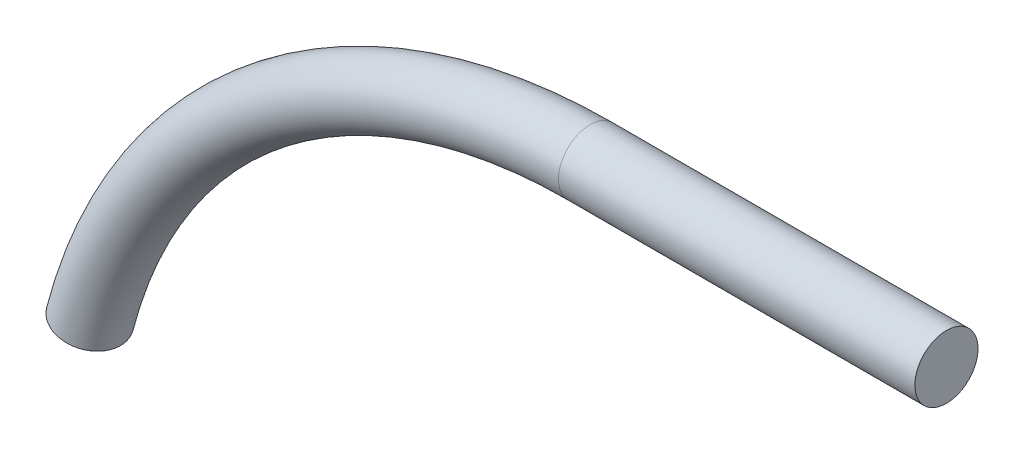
ISO-10303-21;
HEADER;
FILE_DESCRIPTION(('STEP AP214'),'2;1');
FILE_NAME('part.step','',(''),(''),'','','');
FILE_SCHEMA(('AUTOMOTIVE_DESIGN { 1 0 10303 214 1 1 1 1 }'));
ENDSEC;
DATA;
#1=APPLICATION_CONTEXT('core data for automotive mechanical design processes');
#2=APPLICATION_PROTOCOL_DEFINITION('international standard','automotive_design',2000,#1);
#3=PRODUCT_CONTEXT('',#1,'mechanical');
#4=PRODUCT('Part','Part','',(#3));
#5=PRODUCT_RELATED_PRODUCT_CATEGORY('part','',(#4));
#6=PRODUCT_DEFINITION_FORMATION('','',#4);
#7=PRODUCT_DEFINITION_CONTEXT('part definition',#1,'design');
#8=PRODUCT_DEFINITION('design','',#6,#7);
#9=PRODUCT_DEFINITION_SHAPE('','',#8);
#10=(LENGTH_UNIT() NAMED_UNIT(*) SI_UNIT(.MILLI.,.METRE.));
#11=(NAMED_UNIT(*) PLANE_ANGLE_UNIT() SI_UNIT($,.RADIAN.));
#12=(NAMED_UNIT(*) SI_UNIT($,.STERADIAN.) SOLID_ANGLE_UNIT());
#13=UNCERTAINTY_MEASURE_WITH_UNIT(LENGTH_MEASURE(1.E-05),#10,'distance_accuracy_value','');
#14=(GEOMETRIC_REPRESENTATION_CONTEXT(3) GLOBAL_UNCERTAINTY_ASSIGNED_CONTEXT((#13)) GLOBAL_UNIT_ASSIGNED_CONTEXT((#10,
#11,#12)) REPRESENTATION_CONTEXT('',''));
#15=CARTESIAN_POINT('',(0.,0.,0.));
#16=DIRECTION('',(0.,0.,1.));
#17=DIRECTION('',(1.,0.,0.));
#18=AXIS2_PLACEMENT_3D('',#15,#16,#17);
#19=CARTESIAN_POINT('',(-28.207244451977,-40.9002926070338,0.));
#20=DIRECTION('',(0.,0.,1.));
#21=DIRECTION('',(1.,0.,0.));
#22=AXIS2_PLACEMENT_3D('',#19,#20,#21);
#23=TOROIDAL_SURFACE('',#22,40.9002926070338,2.5);
#24=CARTESIAN_POINT('',(-28.207244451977,0.,0.));
#25=DIRECTION('',(1.,0.,0.));
#26=DIRECTION('',(0.,0.,-1.));
#27=AXIS2_PLACEMENT_3D('',#24,#25,#26);
#28=CIRCLE('',#27,2.5);
#29=CARTESIAN_POINT('',(-28.207244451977,2.5,0.));
#30=VERTEX_POINT('',#29);
#31=EDGE_CURVE('E36',#30,#30,#28,.T.);
#32=CARTESIAN_POINT('',(-67.7883012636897,-30.5962217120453,0.));
#33=DIRECTION('',(0.251931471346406,0.967745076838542,0.));
#34=DIRECTION('',(0.,0.,-1.));
#35=AXIS2_PLACEMENT_3D('',#32,#33,#34);
#36=CIRCLE('',#35,2.5);
#37=CARTESIAN_POINT('',(-70.2076639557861,-29.9663930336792,0.));
#38=VERTEX_POINT('',#37);
#39=EDGE_CURVE('E10',#38,#38,#36,.T.);
#40=CARTESIAN_POINT('',(-28.207244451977,-40.9002926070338,0.));
#41=DIRECTION('',(0.,0.,1.));
#42=DIRECTION('',(1.,0.,0.));
#43=AXIS2_PLACEMENT_3D('',#40,#41,#42);
#44=CIRCLE('',#43,43.4002926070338);
#45=EDGE_CURVE('',#30,#38,#44,.T.);
#46=ORIENTED_EDGE('',*,*,#31,.F.);
#47=ORIENTED_EDGE('',*,*,#39,.T.);
#48=ORIENTED_EDGE('',*,*,#45,.T.);
#49=ORIENTED_EDGE('',*,*,#45,.F.);
#50=EDGE_LOOP('',(#46,#48,#47,#49));
#51=FACE_BOUND('',#50,.T.);
#52=ADVANCED_FACE('F30',(#51),#23,.T.);
#53=CARTESIAN_POINT('',(-28.207244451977,0.,0.));
#54=DIRECTION('',(1.,0.,0.));
#55=DIRECTION('',(0.,1.,0.));
#56=AXIS2_PLACEMENT_3D('',#53,#54,#55);
#57=CYLINDRICAL_SURFACE('',#56,2.5);
#58=CARTESIAN_POINT('',(0.,0.,0.));
#59=DIRECTION('',(1.,0.,0.));
#60=DIRECTION('',(0.,0.,-1.));
#61=AXIS2_PLACEMENT_3D('',#58,#59,#60);
#62=CIRCLE('',#61,2.5);
#63=CARTESIAN_POINT('',(0.,2.49999999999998,0.));
#64=VERTEX_POINT('',#63);
#65=EDGE_CURVE('E40',#64,#64,#62,.T.);
#66=CARTESIAN_POINT('',(-28.207244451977,2.49999999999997,0.));
#67=CARTESIAN_POINT('',(-27.9134189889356,2.49999999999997,0.));
#68=CARTESIAN_POINT('',(-27.6195935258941,2.49999999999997,0.));
#69=CARTESIAN_POINT('',(-27.0319425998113,2.49999999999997,0.));
#70=CARTESIAN_POINT('',(-26.7381171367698,2.49999999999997,0.));
#71=CARTESIAN_POINT('',(-26.150466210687,2.49999999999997,0.));
#72=CARTESIAN_POINT('',(-25.8566407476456,2.49999999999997,0.));
#73=CARTESIAN_POINT('',(-25.2689898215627,2.49999999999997,0.));
#74=CARTESIAN_POINT('',(-24.9751643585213,2.49999999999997,0.));
#75=CARTESIAN_POINT('',(-24.3875134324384,2.49999999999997,0.));
#76=CARTESIAN_POINT('',(-24.093687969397,2.49999999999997,0.));
#77=CARTESIAN_POINT('',(-23.5060370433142,2.49999999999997,0.));
#78=CARTESIAN_POINT('',(-23.2122115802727,2.49999999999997,0.));
#79=CARTESIAN_POINT('',(-22.6245606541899,2.49999999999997,0.));
#80=CARTESIAN_POINT('',(-22.3307351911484,2.49999999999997,0.));
#81=CARTESIAN_POINT('',(-21.7430842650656,2.49999999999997,0.));
#82=CARTESIAN_POINT('',(-21.4492588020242,2.49999999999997,0.));
#83=CARTESIAN_POINT('',(-20.8616078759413,2.49999999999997,0.));
#84=CARTESIAN_POINT('',(-20.5677824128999,2.49999999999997,0.));
#85=CARTESIAN_POINT('',(-19.980131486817,2.49999999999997,0.));
#86=CARTESIAN_POINT('',(-19.6863060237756,2.49999999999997,0.));
#87=CARTESIAN_POINT('',(-19.0986550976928,2.49999999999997,0.));
#88=CARTESIAN_POINT('',(-18.8048296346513,2.49999999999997,0.));
#89=CARTESIAN_POINT('',(-18.2171787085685,2.49999999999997,0.));
#90=CARTESIAN_POINT('',(-17.923353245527,2.49999999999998,0.));
#91=CARTESIAN_POINT('',(-17.3357023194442,2.49999999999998,0.));
#92=CARTESIAN_POINT('',(-17.0418768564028,2.49999999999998,0.));
#93=CARTESIAN_POINT('',(-16.4542259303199,2.49999999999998,0.));
#94=CARTESIAN_POINT('',(-16.1604004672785,2.49999999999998,0.));
#95=CARTESIAN_POINT('',(-15.5727495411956,2.49999999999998,0.));
#96=CARTESIAN_POINT('',(-15.2789240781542,2.49999999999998,0.));
#97=CARTESIAN_POINT('',(-14.6912731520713,2.49999999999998,0.));
#98=CARTESIAN_POINT('',(-14.3974476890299,2.49999999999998,0.));
#99=CARTESIAN_POINT('',(-13.8097967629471,2.49999999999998,0.));
#100=CARTESIAN_POINT('',(-13.5159712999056,2.49999999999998,0.));
#101=CARTESIAN_POINT('',(-12.9283203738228,2.49999999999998,0.));
#102=CARTESIAN_POINT('',(-12.6344949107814,2.49999999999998,0.));
#103=CARTESIAN_POINT('',(-12.0468439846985,2.49999999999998,0.));
#104=CARTESIAN_POINT('',(-11.7530185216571,2.49999999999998,0.));
#105=CARTESIAN_POINT('',(-11.1653675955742,2.49999999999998,0.));
#106=CARTESIAN_POINT('',(-10.8715421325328,2.49999999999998,0.));
#107=CARTESIAN_POINT('',(-10.2838912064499,2.49999999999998,0.));
#108=CARTESIAN_POINT('',(-9.99006574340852,2.49999999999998,0.));
#109=CARTESIAN_POINT('',(-9.40241481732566,2.49999999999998,0.));
#110=CARTESIAN_POINT('',(-9.10858935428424,2.49999999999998,0.));
#111=CARTESIAN_POINT('',(-8.52093842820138,2.49999999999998,0.));
#112=CARTESIAN_POINT('',(-8.22711296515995,2.49999999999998,0.));
#113=CARTESIAN_POINT('',(-7.6394620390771,2.49999999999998,0.));
#114=CARTESIAN_POINT('',(-7.34563657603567,2.49999999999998,0.));
#115=CARTESIAN_POINT('',(-6.75798564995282,2.49999999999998,0.));
#116=CARTESIAN_POINT('',(-6.46416018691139,2.49999999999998,0.));
#117=CARTESIAN_POINT('',(-5.87650926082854,2.49999999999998,0.));
#118=CARTESIAN_POINT('',(-5.58268379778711,2.49999999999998,0.));
#119=CARTESIAN_POINT('',(-4.99503287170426,2.49999999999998,0.));
#120=CARTESIAN_POINT('',(-4.70120740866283,2.49999999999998,0.));
#121=CARTESIAN_POINT('',(-4.11355648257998,2.49999999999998,0.));
#122=CARTESIAN_POINT('',(-3.81973101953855,2.49999999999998,0.));
#123=CARTESIAN_POINT('',(-3.2320800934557,2.49999999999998,0.));
#124=CARTESIAN_POINT('',(-2.93825463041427,2.49999999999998,0.));
#125=CARTESIAN_POINT('',(-2.35060370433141,2.49999999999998,0.));
#126=CARTESIAN_POINT('',(-2.05677824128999,2.49999999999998,0.));
#127=CARTESIAN_POINT('',(-1.46912731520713,2.49999999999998,0.));
#128=CARTESIAN_POINT('',(-1.17530185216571,2.49999999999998,0.));
#129=CARTESIAN_POINT('',(-0.587650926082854,2.49999999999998,0.));
#130=CARTESIAN_POINT('',(-0.293825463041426,2.49999999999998,0.));
#131=CARTESIAN_POINT('',(0.,2.49999999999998,0.));
#132=B_SPLINE_CURVE_WITH_KNOTS('',3,(#66,#67,#68,#69,#70,#71,#72,#73,#74,#75,#76,#77,#78,#79,
#80,#81,#82,#83,#84,#85,#86,#87,#88,#89,#90,#91,#92,#93,#94,#95,#96,#97,#98,#99,#100,#101,#102,
#103,#104,#105,#106,#107,#108,#109,#110,#111,#112,#113,#114,#115,#116,#117,#118,#119,#120,#121,
#122,#123,#124,#125,#126,#127,#128,#129,#130,#131),.UNSPECIFIED.,.F.,.F.,(4,2,2,2,2,2,2,2,2,2,2,
2,2,2,2,2,2,2,2,2,2,2,2,2,2,2,2,2,2,2,2,2,4),(0.,0.881476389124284,1.76295277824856,
2.64442916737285,3.52590555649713,4.40738194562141,5.28885833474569,6.17033472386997,
7.05181111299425,7.93328750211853,8.81476389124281,9.69624028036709,10.5777166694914,
11.4591930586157,12.3406694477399,13.2221458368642,14.1036222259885,14.9850986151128,
15.8665750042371,16.7480513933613,17.6295277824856,18.5110041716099,19.3924805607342,
20.2739569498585,21.1554333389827,22.036909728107,22.9183861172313,23.7998625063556,
24.6813388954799,25.5628152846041,26.4442916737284,27.3257680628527,28.207244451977),.UNSPECIFIED.);
#133=EDGE_CURVE('BSEAM49',#30,#64,#132,.T.);
#134=ORIENTED_EDGE('',*,*,#31,.T.);
#135=ORIENTED_EDGE('',*,*,#65,.F.);
#136=ORIENTED_EDGE('',*,*,#133,.T.);
#137=ORIENTED_EDGE('',*,*,#133,.F.);
#138=EDGE_LOOP('',(#134,#136,#135,#137));
#139=FACE_BOUND('',#138,.T.);
#140=ADVANCED_FACE('F49',(#139),#57,.T.);
#141=CARTESIAN_POINT('',(-67.7883012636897,-30.5962217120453,0.));
#142=DIRECTION('',(0.251931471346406,0.967745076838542,0.));
#143=DIRECTION('',(0.,0.,-1.));
#144=AXIS2_PLACEMENT_3D('',#141,#142,#143);
#145=PLANE('',#144);
#146=ORIENTED_EDGE('',*,*,#39,.F.);
#147=EDGE_LOOP('',(#146));
#148=FACE_BOUND('',#147,.T.);
#149=ADVANCED_FACE('F51',(#148),#145,.F.);
#150=CARTESIAN_POINT('',(0.,0.,0.));
#151=DIRECTION('',(1.,0.,0.));
#152=DIRECTION('',(0.,0.,-1.));
#153=AXIS2_PLACEMENT_3D('',#150,#151,#152);
#154=PLANE('',#153);
#155=ORIENTED_EDGE('',*,*,#65,.T.);
#156=EDGE_LOOP('',(#155));
#157=FACE_BOUND('',#156,.T.);
#158=ADVANCED_FACE('F47',(#157),#154,.T.);
#159=CLOSED_SHELL('',(#52,#140,#149,#158));
#160=MANIFOLD_SOLID_BREP('B2',#159);
#161=ADVANCED_BREP_SHAPE_REPRESENTATION('',(#18,#160),#14);
#162=SHAPE_DEFINITION_REPRESENTATION(#9,#161);
ENDSEC;
END-ISO-10303-21;
